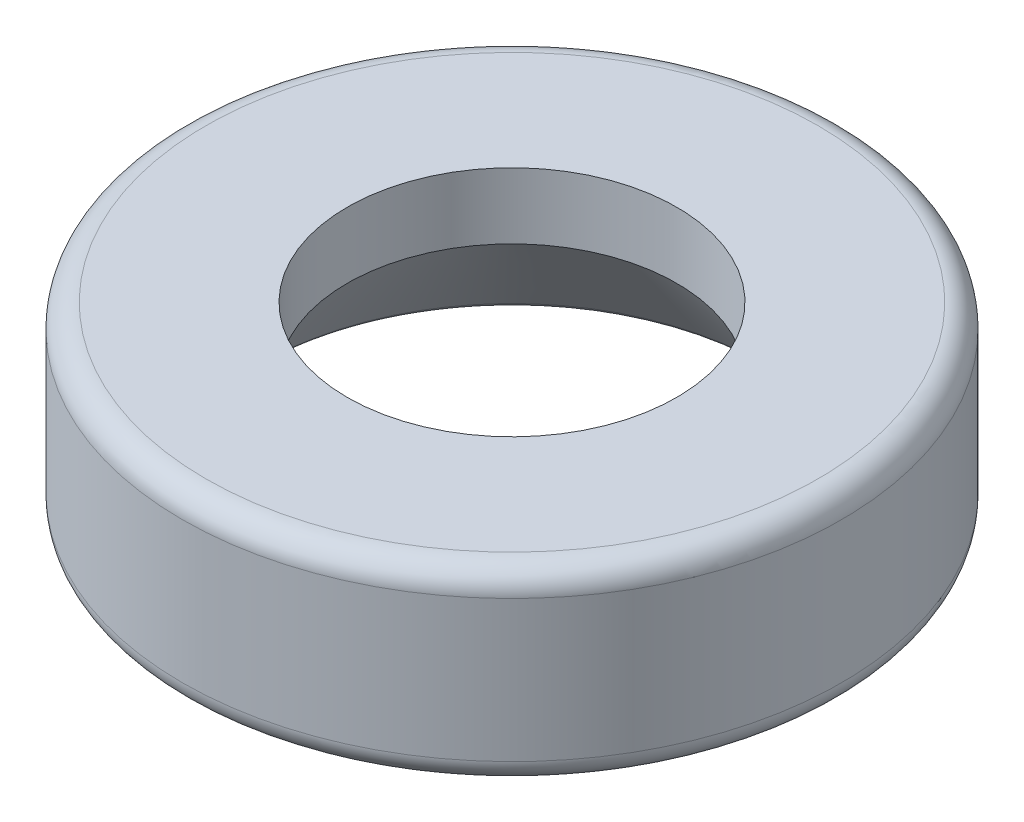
from build123d import *

# Parameters (mm, degrees)
CONG_1_R = 0.5


with BuildPart() as part:
    # Esquisse1 → Base-R_volution (revolve)
    with BuildSketch(Plane.XY, mode=Mode.PRIVATE) as base_r_volution_sk:
        Polygon((-5.5, 0), (-7, 0), (-7, 4), (-3.5, 4), (-3.5, 2.6), align=None)
    revolve(base_r_volution_sk.sketch.rotate(Axis((0, 70, 0), (0, -1, 0)), 270), axis=Axis((0, 70, 0), (0, -1, 0)))

    # Cong_1
    cong_1_edges = [part.edges().sort_by_distance(p)[0] for p in [
        (0, 4, -7),
        (0, 0, -5.5),
        (0, 0, -7),
    ]]
    fillet(cong_1_edges, radius=CONG_1_R)


solid = part.part
